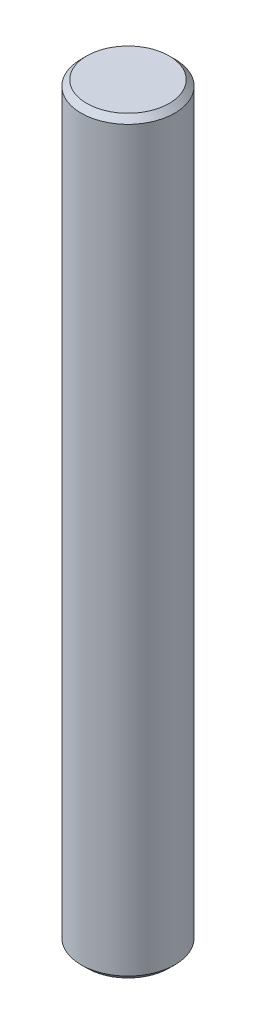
ISO-10303-21;
HEADER;
FILE_DESCRIPTION(('STEP AP214'),'2;1');
FILE_NAME('part.step','',(''),(''),'','','');
FILE_SCHEMA(('AUTOMOTIVE_DESIGN { 1 0 10303 214 1 1 1 1 }'));
ENDSEC;
DATA;
#1=APPLICATION_CONTEXT('core data for automotive mechanical design processes');
#2=APPLICATION_PROTOCOL_DEFINITION('international standard','automotive_design',2000,#1);
#3=PRODUCT_CONTEXT('',#1,'mechanical');
#4=PRODUCT('Part','Part','',(#3));
#5=PRODUCT_RELATED_PRODUCT_CATEGORY('part','',(#4));
#6=PRODUCT_DEFINITION_FORMATION('','',#4);
#7=PRODUCT_DEFINITION_CONTEXT('part definition',#1,'design');
#8=PRODUCT_DEFINITION('design','',#6,#7);
#9=PRODUCT_DEFINITION_SHAPE('','',#8);
#10=(LENGTH_UNIT() NAMED_UNIT(*) SI_UNIT(.MILLI.,.METRE.));
#11=(NAMED_UNIT(*) PLANE_ANGLE_UNIT() SI_UNIT($,.RADIAN.));
#12=(NAMED_UNIT(*) SI_UNIT($,.STERADIAN.) SOLID_ANGLE_UNIT());
#13=UNCERTAINTY_MEASURE_WITH_UNIT(LENGTH_MEASURE(1.E-05),#10,'distance_accuracy_value','');
#14=(GEOMETRIC_REPRESENTATION_CONTEXT(3) GLOBAL_UNCERTAINTY_ASSIGNED_CONTEXT((#13)) GLOBAL_UNIT_ASSIGNED_CONTEXT((#10,
#11,#12)) REPRESENTATION_CONTEXT('',''));
#15=CARTESIAN_POINT('',(0.,0.,0.));
#16=DIRECTION('',(0.,0.,1.));
#17=DIRECTION('',(1.,0.,0.));
#18=AXIS2_PLACEMENT_3D('',#15,#16,#17);
#19=CARTESIAN_POINT('',(0.,50.8,0.));
#20=DIRECTION('',(0.,-1.,0.));
#21=DIRECTION('',(0.,0.,-1.));
#22=AXIS2_PLACEMENT_3D('',#19,#20,#21);
#23=CYLINDRICAL_SURFACE('',#22,6.35254);
#24=CARTESIAN_POINT('',(0.,-50.038,0.));
#25=DIRECTION('',(0.,1.,0.));
#26=DIRECTION('',(0.,0.,1.));
#27=AXIS2_PLACEMENT_3D('',#24,#25,#26);
#28=CIRCLE('',#27,6.35254);
#29=CARTESIAN_POINT('',(0.,-50.038,6.35254));
#30=VERTEX_POINT('',#29);
#31=EDGE_CURVE('E40',#30,#30,#28,.T.);
#32=ORIENTED_EDGE('',*,*,#31,.T.);
#33=EDGE_LOOP('',(#32));
#34=FACE_BOUND('',#33,.T.);
#35=CARTESIAN_POINT('',(0.,50.038,0.));
#36=DIRECTION('',(0.,1.,0.));
#37=DIRECTION('',(0.,0.,1.));
#38=AXIS2_PLACEMENT_3D('',#35,#36,#37);
#39=CIRCLE('',#38,6.35254);
#40=CARTESIAN_POINT('',(0.,50.038,6.35254));
#41=VERTEX_POINT('',#40);
#42=EDGE_CURVE('E44',#41,#41,#39,.F.);
#43=ORIENTED_EDGE('',*,*,#42,.T.);
#44=EDGE_LOOP('',(#43));
#45=FACE_BOUND('',#44,.T.);
#46=ADVANCED_FACE('F29',(#34,#45),#23,.T.);
#47=CARTESIAN_POINT('',(0.,50.8,0.));
#48=DIRECTION('',(0.,1.,0.));
#49=DIRECTION('',(0.,0.,1.));
#50=AXIS2_PLACEMENT_3D('',#47,#48,#49);
#51=PLANE('',#50);
#52=CARTESIAN_POINT('',(0.,50.8,0.));
#53=DIRECTION('',(0.,1.,0.));
#54=DIRECTION('',(0.,0.,1.));
#55=AXIS2_PLACEMENT_3D('',#52,#53,#54);
#56=CIRCLE('',#55,5.59054000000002);
#57=CARTESIAN_POINT('',(0.,50.8,5.59054000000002));
#58=VERTEX_POINT('',#57);
#59=EDGE_CURVE('E10',#58,#58,#56,.T.);
#60=ORIENTED_EDGE('',*,*,#59,.T.);
#61=EDGE_LOOP('',(#60));
#62=FACE_BOUND('',#61,.T.);
#63=ADVANCED_FACE('F60',(#62),#51,.T.);
#64=CARTESIAN_POINT('',(0.,-50.8,0.));
#65=DIRECTION('',(0.,1.,0.));
#66=DIRECTION('',(0.,0.,1.));
#67=AXIS2_PLACEMENT_3D('',#64,#65,#66);
#68=PLANE('',#67);
#69=CARTESIAN_POINT('',(0.,-50.8,0.));
#70=DIRECTION('',(0.,1.,0.));
#71=DIRECTION('',(0.,0.,1.));
#72=AXIS2_PLACEMENT_3D('',#69,#70,#71);
#73=CIRCLE('',#72,5.59054000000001);
#74=CARTESIAN_POINT('',(0.,-50.8,5.59054));
#75=VERTEX_POINT('',#74);
#76=EDGE_CURVE('E36',#75,#75,#73,.F.);
#77=ORIENTED_EDGE('',*,*,#76,.T.);
#78=EDGE_LOOP('',(#77));
#79=FACE_BOUND('',#78,.T.);
#80=ADVANCED_FACE('F57',(#79),#68,.F.);
#81=CARTESIAN_POINT('',(0.,-50.038,0.));
#82=DIRECTION('',(0.,1.,0.));
#83=DIRECTION('',(0.,0.,1.));
#84=AXIS2_PLACEMENT_3D('',#81,#82,#83);
#85=CONICAL_SURFACE('',#84,6.35254,0.785398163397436);
#86=CARTESIAN_POINT('',(0.,-50.8,5.59054));
#87=CARTESIAN_POINT('',(0.,-50.7920625,5.5984775));
#88=CARTESIAN_POINT('',(0.,-50.784125,5.606415));
#89=CARTESIAN_POINT('',(0.,-50.76825,5.62229));
#90=CARTESIAN_POINT('',(0.,-50.7603125,5.6302275));
#91=CARTESIAN_POINT('',(0.,-50.7444375,5.6461025));
#92=CARTESIAN_POINT('',(0.,-50.7365,5.65404));
#93=CARTESIAN_POINT('',(0.,-50.720625,5.669915));
#94=CARTESIAN_POINT('',(0.,-50.7126875,5.6778525));
#95=CARTESIAN_POINT('',(0.,-50.6968125,5.6937275));
#96=CARTESIAN_POINT('',(0.,-50.688875,5.701665));
#97=CARTESIAN_POINT('',(0.,-50.673,5.71754));
#98=CARTESIAN_POINT('',(0.,-50.6650625,5.7254775));
#99=CARTESIAN_POINT('',(0.,-50.6491875,5.7413525));
#100=CARTESIAN_POINT('',(0.,-50.64125,5.74929));
#101=CARTESIAN_POINT('',(0.,-50.625375,5.765165));
#102=CARTESIAN_POINT('',(0.,-50.6174375,5.7731025));
#103=CARTESIAN_POINT('',(0.,-50.6015625,5.7889775));
#104=CARTESIAN_POINT('',(0.,-50.593625,5.796915));
#105=CARTESIAN_POINT('',(0.,-50.57775,5.81279));
#106=CARTESIAN_POINT('',(0.,-50.5698125,5.8207275));
#107=CARTESIAN_POINT('',(0.,-50.5539375,5.8366025));
#108=CARTESIAN_POINT('',(0.,-50.546,5.84454));
#109=CARTESIAN_POINT('',(0.,-50.530125,5.860415));
#110=CARTESIAN_POINT('',(0.,-50.5221875,5.8683525));
#111=CARTESIAN_POINT('',(0.,-50.5063125,5.8842275));
#112=CARTESIAN_POINT('',(0.,-50.498375,5.892165));
#113=CARTESIAN_POINT('',(0.,-50.4825,5.90804));
#114=CARTESIAN_POINT('',(0.,-50.4745625,5.9159775));
#115=CARTESIAN_POINT('',(0.,-50.4586875,5.9318525));
#116=CARTESIAN_POINT('',(0.,-50.45075,5.93979));
#117=CARTESIAN_POINT('',(0.,-50.434875,5.955665));
#118=CARTESIAN_POINT('',(0.,-50.4269375,5.9636025));
#119=CARTESIAN_POINT('',(0.,-50.4110625,5.9794775));
#120=CARTESIAN_POINT('',(0.,-50.403125,5.987415));
#121=CARTESIAN_POINT('',(0.,-50.38725,6.00329));
#122=CARTESIAN_POINT('',(0.,-50.3793125,6.0112275));
#123=CARTESIAN_POINT('',(0.,-50.3634375,6.0271025));
#124=CARTESIAN_POINT('',(0.,-50.3555,6.03504));
#125=CARTESIAN_POINT('',(0.,-50.339625,6.050915));
#126=CARTESIAN_POINT('',(0.,-50.3316875,6.0588525));
#127=CARTESIAN_POINT('',(0.,-50.3158125,6.0747275));
#128=CARTESIAN_POINT('',(0.,-50.307875,6.082665));
#129=CARTESIAN_POINT('',(0.,-50.292,6.09854));
#130=CARTESIAN_POINT('',(0.,-50.2840625,6.1064775));
#131=CARTESIAN_POINT('',(0.,-50.2681875,6.1223525));
#132=CARTESIAN_POINT('',(0.,-50.26025,6.13029));
#133=CARTESIAN_POINT('',(0.,-50.244375,6.146165));
#134=CARTESIAN_POINT('',(0.,-50.2364375,6.1541025));
#135=CARTESIAN_POINT('',(0.,-50.2205625,6.1699775));
#136=CARTESIAN_POINT('',(0.,-50.212625,6.177915));
#137=CARTESIAN_POINT('',(0.,-50.19675,6.19379));
#138=CARTESIAN_POINT('',(0.,-50.1888125,6.2017275));
#139=CARTESIAN_POINT('',(0.,-50.1729375,6.2176025));
#140=CARTESIAN_POINT('',(0.,-50.165,6.22554));
#141=CARTESIAN_POINT('',(0.,-50.149125,6.241415));
#142=CARTESIAN_POINT('',(0.,-50.1411875,6.2493525));
#143=CARTESIAN_POINT('',(0.,-50.1253125,6.2652275));
#144=CARTESIAN_POINT('',(0.,-50.117375,6.273165));
#145=CARTESIAN_POINT('',(0.,-50.1015,6.28904));
#146=CARTESIAN_POINT('',(0.,-50.0935625,6.2969775));
#147=CARTESIAN_POINT('',(0.,-50.0776875,6.3128525));
#148=CARTESIAN_POINT('',(0.,-50.06975,6.32079));
#149=CARTESIAN_POINT('',(0.,-50.053875,6.336665));
#150=CARTESIAN_POINT('',(0.,-50.0459375,6.3446025));
#151=CARTESIAN_POINT('',(0.,-50.038,6.35254));
#152=B_SPLINE_CURVE_WITH_KNOTS('',3,(#86,#87,#88,#89,#90,#91,#92,#93,#94,#95,#96,#97,#98,#99,
#100,#101,#102,#103,#104,#105,#106,#107,#108,#109,#110,#111,#112,#113,#114,#115,#116,#117,#118,
#119,#120,#121,#122,#123,#124,#125,#126,#127,#128,#129,#130,#131,#132,#133,#134,#135,#136,#137,
#138,#139,#140,#141,#142,#143,#144,#145,#146,#147,#148,#149,#150,#151),.UNSPECIFIED.,.F.,.F.,(4,
2,2,2,2,2,2,2,2,2,2,2,2,2,2,2,2,2,2,2,2,2,2,2,2,2,2,2,2,2,2,2,4),(0.,0.0336759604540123,
0.0673519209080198,0.101027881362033,0.13470384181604,0.168379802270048,0.202055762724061,
0.235731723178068,0.269407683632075,0.303083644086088,0.336759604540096,0.370435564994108,
0.404111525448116,0.437787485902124,0.471463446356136,0.505139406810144,0.538815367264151,
0.572491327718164,0.606167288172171,0.639843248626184,0.673519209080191,0.707195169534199,
0.740871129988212,0.774547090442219,0.808223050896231,0.84189901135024,0.875574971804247,
0.909250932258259,0.942926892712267,0.976602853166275,1.01027881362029,1.0439547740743,
1.07763073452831),.UNSPECIFIED.);
#153=EDGE_CURVE('BSEAM53',#75,#30,#152,.T.);
#154=ORIENTED_EDGE('',*,*,#76,.F.);
#155=ORIENTED_EDGE('',*,*,#31,.F.);
#156=ORIENTED_EDGE('',*,*,#153,.T.);
#157=ORIENTED_EDGE('',*,*,#153,.F.);
#158=EDGE_LOOP('',(#154,#156,#155,#157));
#159=FACE_BOUND('',#158,.T.);
#160=ADVANCED_FACE('F53',(#159),#85,.T.);
#161=CARTESIAN_POINT('',(0.,50.8,0.));
#162=DIRECTION('',(0.,-1.,0.));
#163=DIRECTION('',(0.,0.,-1.));
#164=AXIS2_PLACEMENT_3D('',#161,#162,#163);
#165=CONICAL_SURFACE('',#164,5.59054000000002,0.785398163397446);
#166=ORIENTED_EDGE('',*,*,#42,.F.);
#167=EDGE_LOOP('',(#166));
#168=FACE_BOUND('',#167,.T.);
#169=ORIENTED_EDGE('',*,*,#59,.F.);
#170=EDGE_LOOP('',(#169));
#171=FACE_BOUND('',#170,.T.);
#172=ADVANCED_FACE('F31',(#168,#171),#165,.T.);
#173=CLOSED_SHELL('',(#46,#63,#80,#160,#172));
#174=MANIFOLD_SOLID_BREP('B2',#173);
#175=ADVANCED_BREP_SHAPE_REPRESENTATION('',(#18,#174),#14);
#176=SHAPE_DEFINITION_REPRESENTATION(#9,#175);
ENDSEC;
END-ISO-10303-21;
